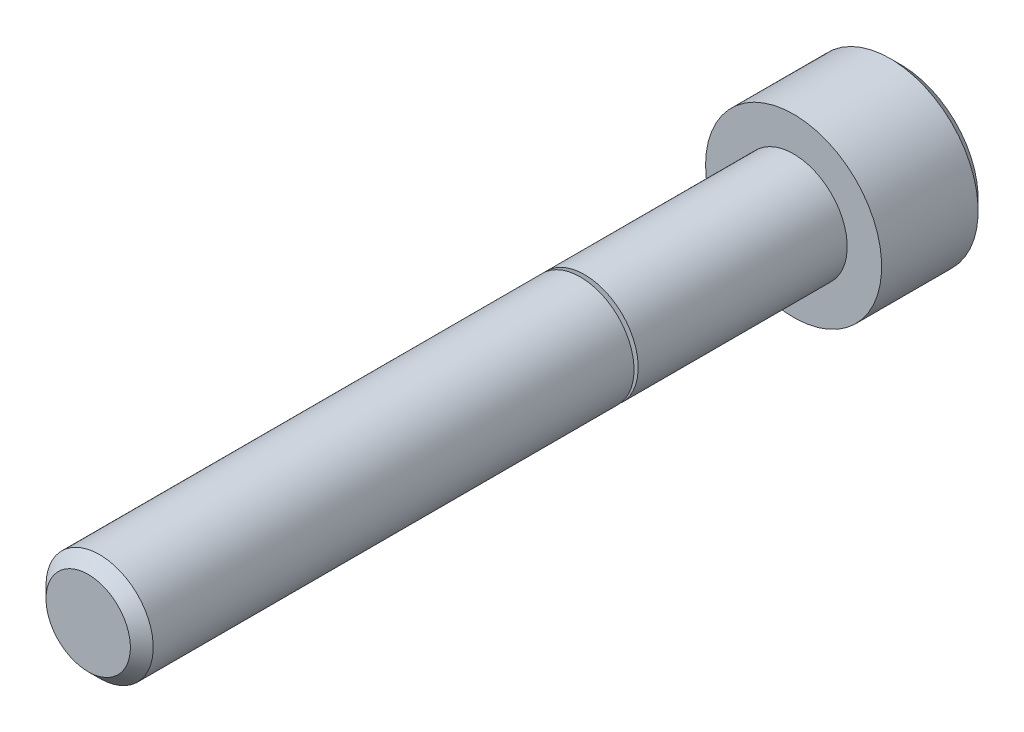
from build123d import *

# Parameters (mm, degrees)
CUT_EXTRUDE1_DEPTH = 2.413


with BuildPart() as part:
    # Logo3_bib1 → Revolve1 (revolve)
    with BuildSketch(Plane(origin=(0, 0, 0), x_dir=(-1, 0, 0), z_dir=(0, -1, 0))):
        with BuildLine():
            Line((0, -31.75), (0, 4.826))
            Line((0, 4.826), (3.4798, 4.826))
            Line((3.4798, 4.826), (3.9624, 4.3434))
            Line((3.9624, 4.3434), (3.9624, 0))
            Line((3.9624, 0), (2.413, 0))
            Line((2.413, 0), (2.413, -9.408))
            Line((2.413, -9.408), (2.012075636, -9.408))
            ThreePointArc((2.012075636, -9.408), (1.992379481, -9.424527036), (2.005235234, -9.446793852))
            Line((2.005235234, -9.446793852), (2.413, -9.59520809))
            Line((2.413, -9.59520809), (2.413, -31.23565))
            Line((2.413, -31.23565), (1.89865, -31.75))
            Line((1.89865, -31.75), (0, -31.75))
        make_face()
    revolve(axis=Axis((0, 0, -10.585154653), (0, 0, 1)))

    # Logo3_bib2 → Cut-Extrude1 (cut)
    with BuildSketch(Plane(origin=(0, 0, -4.826), x_dir=(1, 0, 0), z_dir=(0, 0, -1))):
        Polygon((2.291358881, 0), (1.14567944, 1.984375), (-1.14567944, 1.984375), (-2.291358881, 0), (-1.14567944, -1.984375), (1.14567944, -1.984375), align=None)
    extrude(amount=-CUT_EXTRUDE1_DEPTH, mode=Mode.SUBTRACT)


solid = part.part
